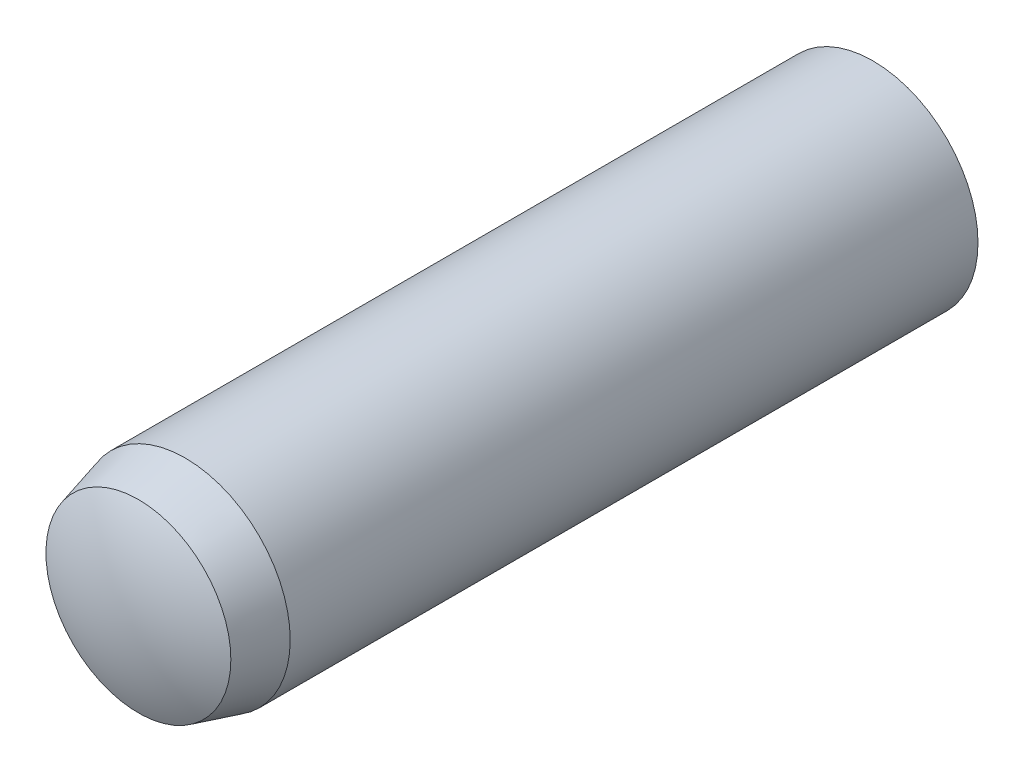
ISO-10303-21;
HEADER;
FILE_DESCRIPTION(('STEP AP214'),'2;1');
FILE_NAME('part.step','',(''),(''),'','','');
FILE_SCHEMA(('AUTOMOTIVE_DESIGN { 1 0 10303 214 1 1 1 1 }'));
ENDSEC;
DATA;
#1=APPLICATION_CONTEXT('core data for automotive mechanical design processes');
#2=APPLICATION_PROTOCOL_DEFINITION('international standard','automotive_design',2000,#1);
#3=PRODUCT_CONTEXT('',#1,'mechanical');
#4=PRODUCT('Part','Part','',(#3));
#5=PRODUCT_RELATED_PRODUCT_CATEGORY('part','',(#4));
#6=PRODUCT_DEFINITION_FORMATION('','',#4);
#7=PRODUCT_DEFINITION_CONTEXT('part definition',#1,'design');
#8=PRODUCT_DEFINITION('design','',#6,#7);
#9=PRODUCT_DEFINITION_SHAPE('','',#8);
#10=(LENGTH_UNIT() NAMED_UNIT(*) SI_UNIT(.MILLI.,.METRE.));
#11=(NAMED_UNIT(*) PLANE_ANGLE_UNIT() SI_UNIT($,.RADIAN.));
#12=(NAMED_UNIT(*) SI_UNIT($,.STERADIAN.) SOLID_ANGLE_UNIT());
#13=UNCERTAINTY_MEASURE_WITH_UNIT(LENGTH_MEASURE(1.E-05),#10,'distance_accuracy_value','');
#14=(GEOMETRIC_REPRESENTATION_CONTEXT(3) GLOBAL_UNCERTAINTY_ASSIGNED_CONTEXT((#13)) GLOBAL_UNIT_ASSIGNED_CONTEXT((#10,
#11,#12)) REPRESENTATION_CONTEXT('',''));
#15=CARTESIAN_POINT('',(0.,0.,0.));
#16=DIRECTION('',(0.,0.,1.));
#17=DIRECTION('',(1.,0.,0.));
#18=AXIS2_PLACEMENT_3D('',#15,#16,#17);
#19=CARTESIAN_POINT('',(0.,0.,27.4));
#20=DIRECTION('',(0.,0.,-1.));
#21=DIRECTION('',(-1.,0.,0.));
#22=AXIS2_PLACEMENT_3D('',#19,#20,#21);
#23=CONICAL_SURFACE('',#22,4.,0.261799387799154);
#24=CARTESIAN_POINT('',(0.,0.,29.18286295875));
#25=DIRECTION('',(0.,0.,1.));
#26=DIRECTION('',(1.,0.,0.));
#27=AXIS2_PLACEMENT_3D('',#24,#25,#26);
#28=CIRCLE('',#27,3.52228330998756);
#29=CARTESIAN_POINT('',(3.52228330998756,0.,29.18286295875));
#30=VERTEX_POINT('',#29);
#31=EDGE_CURVE('E13',#30,#30,#28,.T.);
#32=ORIENTED_EDGE('',*,*,#31,.F.);
#33=EDGE_LOOP('',(#32));
#34=FACE_BOUND('',#33,.T.);
#35=CARTESIAN_POINT('',(0.,0.,27.4));
#36=DIRECTION('',(0.,0.,1.));
#37=DIRECTION('',(1.,0.,0.));
#38=AXIS2_PLACEMENT_3D('',#35,#36,#37);
#39=CIRCLE('',#38,4.);
#40=CARTESIAN_POINT('',(4.,0.,27.4));
#41=VERTEX_POINT('',#40);
#42=EDGE_CURVE('E59',#41,#41,#39,.T.);
#43=ORIENTED_EDGE('',*,*,#42,.T.);
#44=EDGE_LOOP('',(#43));
#45=FACE_BOUND('',#44,.T.);
#46=ADVANCED_FACE('F24',(#34,#45),#23,.T.);
#47=CARTESIAN_POINT('',(0.,0.,22.));
#48=DIRECTION('',(0.,0.,1.));
#49=DIRECTION('',(0.,1.,0.));
#50=AXIS2_PLACEMENT_3D('',#47,#48,#49);
#51=SPHERICAL_SURFACE('',#50,8.);
#52=ORIENTED_EDGE('',*,*,#31,.T.);
#53=EDGE_LOOP('',(#52));
#54=FACE_BOUND('',#53,.T.);
#55=ADVANCED_FACE('F37',(#54),#51,.T.);
#56=CARTESIAN_POINT('',(-0.219099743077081,0.,7.99699914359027));
#57=DIRECTION('',(0.,-1.,0.));
#58=DIRECTION('',(1.,0.,0.));
#59=AXIS2_PLACEMENT_3D('',#56,#57,#58);
#60=CIRCLE('',#59,8.);
#61=TRIMMED_CURVE('',#60,(PARAMETER_VALUE(-1.5434054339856)),(PARAMETER_VALUE(1.5434054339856)),
.T.,.PARAMETER.);
#62=CARTESIAN_POINT('',(0.,0.,7.99699914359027));
#63=DIRECTION('',(0.,0.,1.));
#64=AXIS1_PLACEMENT('',#62,#63);
#65=SURFACE_OF_REVOLUTION('',#61,#64);
#66=CARTESIAN_POINT('',(0.,0.,1.2));
#67=DIRECTION('',(0.,0.,1.));
#68=DIRECTION('',(1.,0.,0.));
#69=AXIS2_PLACEMENT_3D('',#66,#67,#68);
#70=CIRCLE('',#69,4.);
#71=CARTESIAN_POINT('',(4.,0.,1.2));
#72=VERTEX_POINT('',#71);
#73=EDGE_CURVE('E31',#72,#72,#70,.T.);
#74=ORIENTED_EDGE('',*,*,#73,.F.);
#75=EDGE_LOOP('',(#74));
#76=FACE_BOUND('',#75,.T.);
#77=CARTESIAN_POINT('',(0.,0.,0.));
#78=VERTEX_POINT('',#77);
#79=VERTEX_LOOP('',#78);
#80=FACE_BOUND('',#79,.T.);
#81=ADVANCED_FACE('F34',(#76,#80),#65,.T.);
#82=CARTESIAN_POINT('',(0.,0.,0.));
#83=DIRECTION('',(0.,0.,1.));
#84=DIRECTION('',(1.,0.,0.));
#85=AXIS2_PLACEMENT_3D('',#82,#83,#84);
#86=CYLINDRICAL_SURFACE('',#85,4.);
#87=ORIENTED_EDGE('',*,*,#42,.F.);
#88=EDGE_LOOP('',(#87));
#89=FACE_BOUND('',#88,.T.);
#90=ORIENTED_EDGE('',*,*,#73,.T.);
#91=EDGE_LOOP('',(#90));
#92=FACE_BOUND('',#91,.T.);
#93=ADVANCED_FACE('F36',(#89,#92),#86,.T.);
#94=CLOSED_SHELL('',(#46,#55,#81,#93));
#95=MANIFOLD_SOLID_BREP('B1',#94);
#96=ADVANCED_BREP_SHAPE_REPRESENTATION('',(#18,#95),#14);
#97=SHAPE_DEFINITION_REPRESENTATION(#9,#96);
ENDSEC;
END-ISO-10303-21;
